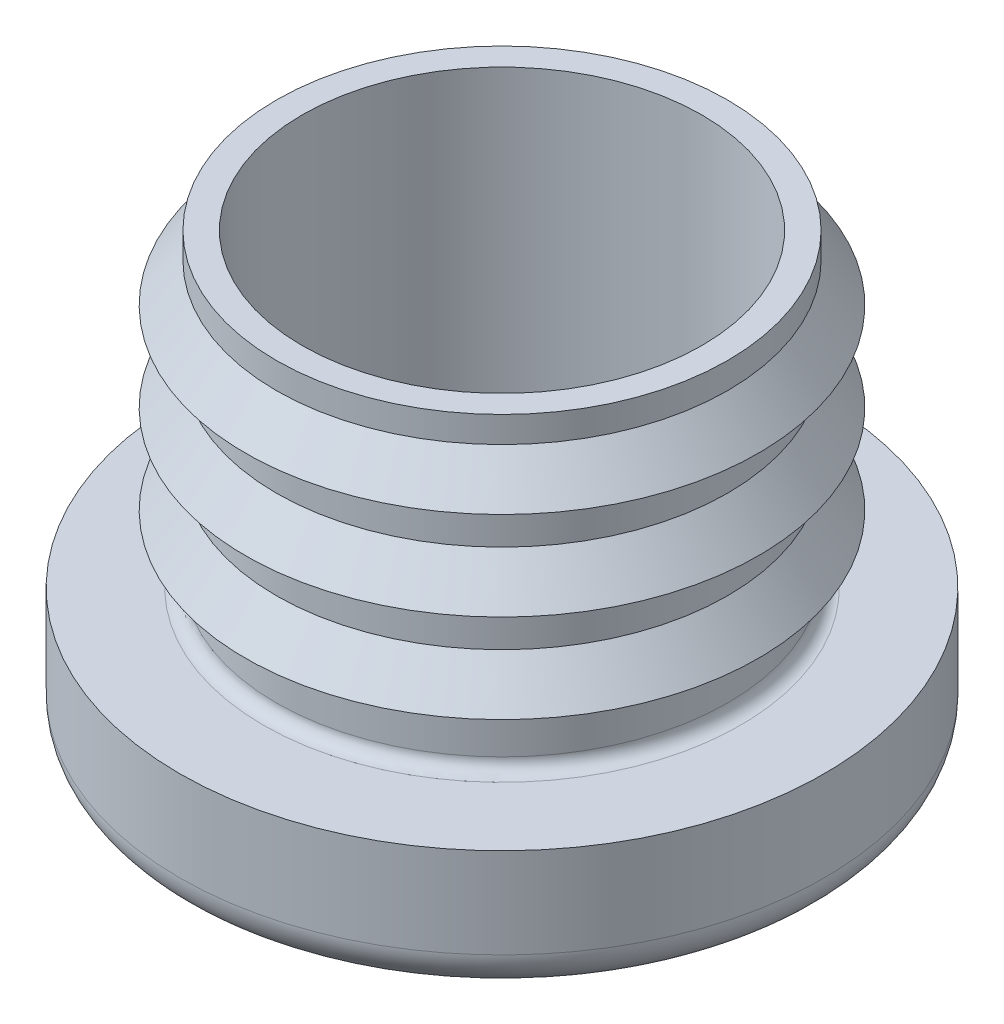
ISO-10303-21;
HEADER;
FILE_DESCRIPTION(('STEP AP214'),'2;1');
FILE_NAME('part.step','',(''),(''),'','','');
FILE_SCHEMA(('AUTOMOTIVE_DESIGN { 1 0 10303 214 1 1 1 1 }'));
ENDSEC;
DATA;
#1=APPLICATION_CONTEXT('core data for automotive mechanical design processes');
#2=APPLICATION_PROTOCOL_DEFINITION('international standard','automotive_design',2000,#1);
#3=PRODUCT_CONTEXT('',#1,'mechanical');
#4=PRODUCT('Part','Part','',(#3));
#5=PRODUCT_RELATED_PRODUCT_CATEGORY('part','',(#4));
#6=PRODUCT_DEFINITION_FORMATION('','',#4);
#7=PRODUCT_DEFINITION_CONTEXT('part definition',#1,'design');
#8=PRODUCT_DEFINITION('design','',#6,#7);
#9=PRODUCT_DEFINITION_SHAPE('','',#8);
#10=(LENGTH_UNIT() NAMED_UNIT(*) SI_UNIT(.MILLI.,.METRE.));
#11=(NAMED_UNIT(*) PLANE_ANGLE_UNIT() SI_UNIT($,.RADIAN.));
#12=(NAMED_UNIT(*) SI_UNIT($,.STERADIAN.) SOLID_ANGLE_UNIT());
#13=UNCERTAINTY_MEASURE_WITH_UNIT(LENGTH_MEASURE(1.E-05),#10,'distance_accuracy_value','');
#14=(GEOMETRIC_REPRESENTATION_CONTEXT(3) GLOBAL_UNCERTAINTY_ASSIGNED_CONTEXT((#13)) GLOBAL_UNIT_ASSIGNED_CONTEXT((#10,
#11,#12)) REPRESENTATION_CONTEXT('',''));
#15=CARTESIAN_POINT('',(0.,0.,0.));
#16=DIRECTION('',(0.,0.,1.));
#17=DIRECTION('',(1.,0.,0.));
#18=AXIS2_PLACEMENT_3D('',#15,#16,#17);
#19=CARTESIAN_POINT('',(0.,1.5,0.));
#20=DIRECTION('',(0.,-1.,0.));
#21=DIRECTION('',(0.,0.,-1.));
#22=AXIS2_PLACEMENT_3D('',#19,#20,#21);
#23=TOROIDAL_SURFACE('',#22,11.,1.5);
#24=CARTESIAN_POINT('',(0.,0.,0.));
#25=DIRECTION('',(0.,-1.,0.));
#26=DIRECTION('',(0.,0.,-1.));
#27=AXIS2_PLACEMENT_3D('',#24,#25,#26);
#28=CIRCLE('',#27,11.);
#29=CARTESIAN_POINT('',(0.,0.,-11.));
#30=VERTEX_POINT('',#29);
#31=EDGE_CURVE('E10',#30,#30,#28,.T.);
#32=ORIENTED_EDGE('',*,*,#31,.F.);
#33=EDGE_LOOP('',(#32));
#34=FACE_BOUND('',#33,.T.);
#35=CARTESIAN_POINT('',(0.,1.5,0.));
#36=DIRECTION('',(0.,-1.,0.));
#37=DIRECTION('',(0.,0.,-1.));
#38=AXIS2_PLACEMENT_3D('',#35,#36,#37);
#39=CIRCLE('',#38,12.5);
#40=CARTESIAN_POINT('',(0.,1.5,-12.5));
#41=VERTEX_POINT('',#40);
#42=EDGE_CURVE('E86',#41,#41,#39,.T.);
#43=ORIENTED_EDGE('',*,*,#42,.T.);
#44=EDGE_LOOP('',(#43));
#45=FACE_BOUND('',#44,.T.);
#46=ADVANCED_FACE('F28',(#34,#45),#23,.T.);
#47=CARTESIAN_POINT('',(-11.,0.,0.));
#48=DIRECTION('',(0.,1.,0.));
#49=DIRECTION('',(0.,0.,1.));
#50=AXIS2_PLACEMENT_3D('',#47,#48,#49);
#51=PLANE('',#50);
#52=ORIENTED_EDGE('',*,*,#31,.T.);
#53=EDGE_LOOP('',(#52));
#54=FACE_BOUND('',#53,.T.);
#55=ADVANCED_FACE('F188',(#54),#51,.F.);
#56=CARTESIAN_POINT('',(0.,3.,0.));
#57=DIRECTION('',(0.,-1.,0.));
#58=DIRECTION('',(0.,0.,-1.));
#59=AXIS2_PLACEMENT_3D('',#56,#57,#58);
#60=PLANE('',#59);
#61=CARTESIAN_POINT('',(0.,3.,0.));
#62=DIRECTION('',(0.,-1.,0.));
#63=DIRECTION('',(0.,0.,-1.));
#64=AXIS2_PLACEMENT_3D('',#61,#62,#63);
#65=CIRCLE('',#64,7.25);
#66=CARTESIAN_POINT('',(0.,3.,-7.25));
#67=VERTEX_POINT('',#66);
#68=EDGE_CURVE('E34',#67,#67,#65,.T.);
#69=ORIENTED_EDGE('',*,*,#68,.F.);
#70=EDGE_LOOP('',(#69));
#71=FACE_BOUND('',#70,.T.);
#72=ADVANCED_FACE('F183',(#71),#60,.F.);
#73=CARTESIAN_POINT('',(0.,3.5,0.));
#74=DIRECTION('',(0.,-1.,0.));
#75=DIRECTION('',(0.,0.,-1.));
#76=AXIS2_PLACEMENT_3D('',#73,#74,#75);
#77=TOROIDAL_SURFACE('',#76,7.25,0.5);
#78=CARTESIAN_POINT('',(0.,3.5,0.));
#79=DIRECTION('',(0.,-1.,0.));
#80=DIRECTION('',(0.,0.,-1.));
#81=AXIS2_PLACEMENT_3D('',#78,#79,#80);
#82=CIRCLE('',#81,7.75);
#83=CARTESIAN_POINT('',(0.,3.5,-7.75));
#84=VERTEX_POINT('',#83);
#85=EDGE_CURVE('E38',#84,#84,#82,.T.);
#86=ORIENTED_EDGE('',*,*,#85,.F.);
#87=EDGE_LOOP('',(#86));
#88=FACE_BOUND('',#87,.T.);
#89=ORIENTED_EDGE('',*,*,#68,.T.);
#90=EDGE_LOOP('',(#89));
#91=FACE_BOUND('',#90,.T.);
#92=ADVANCED_FACE('F178',(#88,#91),#77,.F.);
#93=CARTESIAN_POINT('',(0.,0.,0.));
#94=DIRECTION('',(0.,-1.,0.));
#95=DIRECTION('',(0.,0.,-1.));
#96=AXIS2_PLACEMENT_3D('',#93,#94,#95);
#97=CYLINDRICAL_SURFACE('',#96,7.75);
#98=CARTESIAN_POINT('',(0.,17.,0.));
#99=DIRECTION('',(0.,-1.,0.));
#100=DIRECTION('',(0.,0.,-1.));
#101=AXIS2_PLACEMENT_3D('',#98,#99,#100);
#102=CIRCLE('',#101,7.75);
#103=CARTESIAN_POINT('',(0.,17.,-7.75));
#104=VERTEX_POINT('',#103);
#105=EDGE_CURVE('E42',#104,#104,#102,.T.);
#106=ORIENTED_EDGE('',*,*,#105,.F.);
#107=EDGE_LOOP('',(#106));
#108=FACE_BOUND('',#107,.T.);
#109=ORIENTED_EDGE('',*,*,#85,.T.);
#110=EDGE_LOOP('',(#109));
#111=FACE_BOUND('',#110,.T.);
#112=ADVANCED_FACE('F172',(#108,#111),#97,.F.);
#113=CARTESIAN_POINT('',(-7.75,17.,0.));
#114=DIRECTION('',(0.,-1.,0.));
#115=DIRECTION('',(0.,0.,-1.));
#116=AXIS2_PLACEMENT_3D('',#113,#114,#115);
#117=PLANE('',#116);
#118=CARTESIAN_POINT('',(0.,17.,0.));
#119=DIRECTION('',(0.,-1.,0.));
#120=DIRECTION('',(0.,0.,-1.));
#121=AXIS2_PLACEMENT_3D('',#118,#119,#120);
#122=CIRCLE('',#121,8.75000000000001);
#123=CARTESIAN_POINT('',(0.,17.,-8.75000000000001));
#124=VERTEX_POINT('',#123);
#125=EDGE_CURVE('E47',#124,#124,#122,.T.);
#126=ORIENTED_EDGE('',*,*,#125,.F.);
#127=EDGE_LOOP('',(#126));
#128=FACE_BOUND('',#127,.T.);
#129=ORIENTED_EDGE('',*,*,#105,.T.);
#130=EDGE_LOOP('',(#129));
#131=FACE_BOUND('',#130,.T.);
#132=ADVANCED_FACE('F166',(#128,#131),#117,.F.);
#133=CARTESIAN_POINT('',(0.,0.,0.));
#134=DIRECTION('',(0.,-1.,0.));
#135=DIRECTION('',(0.,0.,-1.));
#136=AXIS2_PLACEMENT_3D('',#133,#134,#135);
#137=CYLINDRICAL_SURFACE('',#136,8.75000000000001);
#138=CARTESIAN_POINT('',(0.,15.9876094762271,0.));
#139=DIRECTION('',(0.,-1.,0.));
#140=DIRECTION('',(0.,0.,-1.));
#141=AXIS2_PLACEMENT_3D('',#138,#139,#140);
#142=CIRCLE('',#141,8.75000000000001);
#143=CARTESIAN_POINT('',(0.,15.9876094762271,-8.75000000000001));
#144=VERTEX_POINT('',#143);
#145=EDGE_CURVE('E50',#144,#144,#142,.T.);
#146=ORIENTED_EDGE('',*,*,#145,.F.);
#147=EDGE_LOOP('',(#146));
#148=FACE_BOUND('',#147,.T.);
#149=ORIENTED_EDGE('',*,*,#125,.T.);
#150=EDGE_LOOP('',(#149));
#151=FACE_BOUND('',#150,.T.);
#152=ADVANCED_FACE('F160',(#148,#151),#137,.T.);
#153=CARTESIAN_POINT('',(0.,15.9876094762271,0.));
#154=DIRECTION('',(0.,-1.,0.));
#155=DIRECTION('',(0.,0.,-1.));
#156=AXIS2_PLACEMENT_3D('',#153,#154,#155);
#157=CONICAL_SURFACE('',#156,8.75000000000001,0.67460878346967);
#158=CARTESIAN_POINT('',(0.,14.4876094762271,0.));
#159=DIRECTION('',(0.,-1.,0.));
#160=DIRECTION('',(0.,0.,-1.));
#161=AXIS2_PLACEMENT_3D('',#158,#159,#160);
#162=CIRCLE('',#161,9.94967492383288);
#163=CARTESIAN_POINT('',(0.,14.4876094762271,-9.94967492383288));
#164=VERTEX_POINT('',#163);
#165=EDGE_CURVE('E53',#164,#164,#162,.T.);
#166=ORIENTED_EDGE('',*,*,#165,.F.);
#167=EDGE_LOOP('',(#166));
#168=FACE_BOUND('',#167,.T.);
#169=ORIENTED_EDGE('',*,*,#145,.T.);
#170=EDGE_LOOP('',(#169));
#171=FACE_BOUND('',#170,.T.);
#172=ADVANCED_FACE('F154',(#168,#171),#157,.T.);
#173=CARTESIAN_POINT('',(-9.94967492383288,14.4876094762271,0.));
#174=DIRECTION('',(0.,1.,0.));
#175=DIRECTION('',(0.,0.,1.));
#176=AXIS2_PLACEMENT_3D('',#173,#174,#175);
#177=PLANE('',#176);
#178=CARTESIAN_POINT('',(0.,14.4876094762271,0.));
#179=DIRECTION('',(0.,-1.,0.));
#180=DIRECTION('',(0.,0.,-1.));
#181=AXIS2_PLACEMENT_3D('',#178,#179,#180);
#182=CIRCLE('',#181,8.75000000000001);
#183=CARTESIAN_POINT('',(0.,14.4876094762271,-8.75000000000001));
#184=VERTEX_POINT('',#183);
#185=EDGE_CURVE('E56',#184,#184,#182,.T.);
#186=ORIENTED_EDGE('',*,*,#185,.F.);
#187=EDGE_LOOP('',(#186));
#188=FACE_BOUND('',#187,.T.);
#189=ORIENTED_EDGE('',*,*,#165,.T.);
#190=EDGE_LOOP('',(#189));
#191=FACE_BOUND('',#190,.T.);
#192=ADVANCED_FACE('F148',(#188,#191),#177,.F.);
#193=CARTESIAN_POINT('',(0.,0.,0.));
#194=DIRECTION('',(0.,-1.,0.));
#195=DIRECTION('',(0.,0.,-1.));
#196=AXIS2_PLACEMENT_3D('',#193,#194,#195);
#197=CYLINDRICAL_SURFACE('',#196,8.75000000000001);
#198=CARTESIAN_POINT('',(0.,12.5438047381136,0.));
#199=DIRECTION('',(0.,-1.,0.));
#200=DIRECTION('',(0.,0.,-1.));
#201=AXIS2_PLACEMENT_3D('',#198,#199,#200);
#202=CIRCLE('',#201,8.75000000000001);
#203=CARTESIAN_POINT('',(0.,12.5438047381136,-8.75000000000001));
#204=VERTEX_POINT('',#203);
#205=EDGE_CURVE('E59',#204,#204,#202,.T.);
#206=ORIENTED_EDGE('',*,*,#205,.F.);
#207=EDGE_LOOP('',(#206));
#208=FACE_BOUND('',#207,.T.);
#209=ORIENTED_EDGE('',*,*,#185,.T.);
#210=EDGE_LOOP('',(#209));
#211=FACE_BOUND('',#210,.T.);
#212=ADVANCED_FACE('F142',(#208,#211),#197,.T.);
#213=CARTESIAN_POINT('',(0.,12.5438047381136,0.));
#214=DIRECTION('',(0.,-1.,0.));
#215=DIRECTION('',(0.,0.,-1.));
#216=AXIS2_PLACEMENT_3D('',#213,#214,#215);
#217=CONICAL_SURFACE('',#216,8.75000000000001,0.674608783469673);
#218=CARTESIAN_POINT('',(0.,11.0438047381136,0.));
#219=DIRECTION('',(0.,-1.,0.));
#220=DIRECTION('',(0.,0.,-1.));
#221=AXIS2_PLACEMENT_3D('',#218,#219,#220);
#222=CIRCLE('',#221,9.94967492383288);
#223=CARTESIAN_POINT('',(0.,11.0438047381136,-9.94967492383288));
#224=VERTEX_POINT('',#223);
#225=EDGE_CURVE('E62',#224,#224,#222,.T.);
#226=ORIENTED_EDGE('',*,*,#225,.F.);
#227=EDGE_LOOP('',(#226));
#228=FACE_BOUND('',#227,.T.);
#229=ORIENTED_EDGE('',*,*,#205,.T.);
#230=EDGE_LOOP('',(#229));
#231=FACE_BOUND('',#230,.T.);
#232=ADVANCED_FACE('F136',(#228,#231),#217,.T.);
#233=CARTESIAN_POINT('',(-9.94967492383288,11.0438047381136,0.));
#234=DIRECTION('',(0.,1.,0.));
#235=DIRECTION('',(0.,0.,1.));
#236=AXIS2_PLACEMENT_3D('',#233,#234,#235);
#237=PLANE('',#236);
#238=CARTESIAN_POINT('',(0.,11.0438047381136,0.));
#239=DIRECTION('',(0.,-1.,0.));
#240=DIRECTION('',(0.,0.,-1.));
#241=AXIS2_PLACEMENT_3D('',#238,#239,#240);
#242=CIRCLE('',#241,8.75000000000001);
#243=CARTESIAN_POINT('',(0.,11.0438047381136,-8.75000000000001));
#244=VERTEX_POINT('',#243);
#245=EDGE_CURVE('E65',#244,#244,#242,.T.);
#246=ORIENTED_EDGE('',*,*,#245,.F.);
#247=EDGE_LOOP('',(#246));
#248=FACE_BOUND('',#247,.T.);
#249=ORIENTED_EDGE('',*,*,#225,.T.);
#250=EDGE_LOOP('',(#249));
#251=FACE_BOUND('',#250,.T.);
#252=ADVANCED_FACE('F130',(#248,#251),#237,.F.);
#253=CARTESIAN_POINT('',(0.,0.,0.));
#254=DIRECTION('',(0.,-1.,0.));
#255=DIRECTION('',(0.,0.,-1.));
#256=AXIS2_PLACEMENT_3D('',#253,#254,#255);
#257=CYLINDRICAL_SURFACE('',#256,8.75);
#258=CARTESIAN_POINT('',(0.,9.1,0.));
#259=DIRECTION('',(0.,-1.,0.));
#260=DIRECTION('',(0.,0.,-1.));
#261=AXIS2_PLACEMENT_3D('',#258,#259,#260);
#262=CIRCLE('',#261,8.75);
#263=CARTESIAN_POINT('',(0.,9.1,-8.75));
#264=VERTEX_POINT('',#263);
#265=EDGE_CURVE('E68',#264,#264,#262,.T.);
#266=ORIENTED_EDGE('',*,*,#265,.F.);
#267=EDGE_LOOP('',(#266));
#268=FACE_BOUND('',#267,.T.);
#269=ORIENTED_EDGE('',*,*,#245,.T.);
#270=EDGE_LOOP('',(#269));
#271=FACE_BOUND('',#270,.T.);
#272=ADVANCED_FACE('F124',(#268,#271),#257,.T.);
#273=CARTESIAN_POINT('',(0.,9.1,0.));
#274=DIRECTION('',(0.,-1.,0.));
#275=DIRECTION('',(0.,0.,-1.));
#276=AXIS2_PLACEMENT_3D('',#273,#274,#275);
#277=CONICAL_SURFACE('',#276,8.75,0.674608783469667);
#278=CARTESIAN_POINT('',(0.,7.6,0.));
#279=DIRECTION('',(0.,-1.,0.));
#280=DIRECTION('',(0.,0.,-1.));
#281=AXIS2_PLACEMENT_3D('',#278,#279,#280);
#282=CIRCLE('',#281,9.94967492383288);
#283=CARTESIAN_POINT('',(0.,7.6,-9.94967492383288));
#284=VERTEX_POINT('',#283);
#285=EDGE_CURVE('E71',#284,#284,#282,.T.);
#286=ORIENTED_EDGE('',*,*,#285,.F.);
#287=EDGE_LOOP('',(#286));
#288=FACE_BOUND('',#287,.T.);
#289=ORIENTED_EDGE('',*,*,#265,.T.);
#290=EDGE_LOOP('',(#289));
#291=FACE_BOUND('',#290,.T.);
#292=ADVANCED_FACE('F118',(#288,#291),#277,.T.);
#293=CARTESIAN_POINT('',(-9.94967492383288,7.6,0.));
#294=DIRECTION('',(0.,1.,0.));
#295=DIRECTION('',(0.,0.,1.));
#296=AXIS2_PLACEMENT_3D('',#293,#294,#295);
#297=PLANE('',#296);
#298=CARTESIAN_POINT('',(0.,7.6,0.));
#299=DIRECTION('',(0.,-1.,0.));
#300=DIRECTION('',(0.,0.,-1.));
#301=AXIS2_PLACEMENT_3D('',#298,#299,#300);
#302=CIRCLE('',#301,8.75);
#303=CARTESIAN_POINT('',(0.,7.6,-8.75));
#304=VERTEX_POINT('',#303);
#305=EDGE_CURVE('E74',#304,#304,#302,.T.);
#306=ORIENTED_EDGE('',*,*,#305,.F.);
#307=EDGE_LOOP('',(#306));
#308=FACE_BOUND('',#307,.T.);
#309=ORIENTED_EDGE('',*,*,#285,.T.);
#310=EDGE_LOOP('',(#309));
#311=FACE_BOUND('',#310,.T.);
#312=ADVANCED_FACE('F112',(#308,#311),#297,.F.);
#313=CARTESIAN_POINT('',(0.,0.,0.));
#314=DIRECTION('',(0.,-1.,0.));
#315=DIRECTION('',(0.,0.,-1.));
#316=AXIS2_PLACEMENT_3D('',#313,#314,#315);
#317=CYLINDRICAL_SURFACE('',#316,8.75);
#318=CARTESIAN_POINT('',(0.,5.5,0.));
#319=DIRECTION('',(0.,-1.,0.));
#320=DIRECTION('',(0.,0.,-1.));
#321=AXIS2_PLACEMENT_3D('',#318,#319,#320);
#322=CIRCLE('',#321,8.75);
#323=CARTESIAN_POINT('',(0.,5.5,-8.75));
#324=VERTEX_POINT('',#323);
#325=EDGE_CURVE('E77',#324,#324,#322,.T.);
#326=ORIENTED_EDGE('',*,*,#325,.F.);
#327=EDGE_LOOP('',(#326));
#328=FACE_BOUND('',#327,.T.);
#329=ORIENTED_EDGE('',*,*,#305,.T.);
#330=EDGE_LOOP('',(#329));
#331=FACE_BOUND('',#330,.T.);
#332=ADVANCED_FACE('F106',(#328,#331),#317,.T.);
#333=CARTESIAN_POINT('',(0.,5.5,0.));
#334=DIRECTION('',(0.,-1.,0.));
#335=DIRECTION('',(0.,0.,-1.));
#336=AXIS2_PLACEMENT_3D('',#333,#334,#335);
#337=TOROIDAL_SURFACE('',#336,9.25000000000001,0.500000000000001);
#338=CARTESIAN_POINT('',(0.,5.,0.));
#339=DIRECTION('',(0.,-1.,0.));
#340=DIRECTION('',(0.,0.,-1.));
#341=AXIS2_PLACEMENT_3D('',#338,#339,#340);
#342=CIRCLE('',#341,9.25000000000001);
#343=CARTESIAN_POINT('',(0.,5.,-9.25000000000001));
#344=VERTEX_POINT('',#343);
#345=EDGE_CURVE('E80',#344,#344,#342,.T.);
#346=ORIENTED_EDGE('',*,*,#345,.F.);
#347=EDGE_LOOP('',(#346));
#348=FACE_BOUND('',#347,.T.);
#349=ORIENTED_EDGE('',*,*,#325,.T.);
#350=EDGE_LOOP('',(#349));
#351=FACE_BOUND('',#350,.T.);
#352=ADVANCED_FACE('F100',(#348,#351),#337,.F.);
#353=CARTESIAN_POINT('',(-9.25000000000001,5.,0.));
#354=DIRECTION('',(0.,-1.,0.));
#355=DIRECTION('',(0.,0.,-1.));
#356=AXIS2_PLACEMENT_3D('',#353,#354,#355);
#357=PLANE('',#356);
#358=CARTESIAN_POINT('',(0.,5.,0.));
#359=DIRECTION('',(0.,-1.,0.));
#360=DIRECTION('',(0.,0.,-1.));
#361=AXIS2_PLACEMENT_3D('',#358,#359,#360);
#362=CIRCLE('',#361,12.5);
#363=CARTESIAN_POINT('',(0.,5.,-12.5));
#364=VERTEX_POINT('',#363);
#365=EDGE_CURVE('E83',#364,#364,#362,.T.);
#366=ORIENTED_EDGE('',*,*,#365,.F.);
#367=EDGE_LOOP('',(#366));
#368=FACE_BOUND('',#367,.T.);
#369=ORIENTED_EDGE('',*,*,#345,.T.);
#370=EDGE_LOOP('',(#369));
#371=FACE_BOUND('',#370,.T.);
#372=ADVANCED_FACE('F94',(#368,#371),#357,.F.);
#373=CARTESIAN_POINT('',(0.,0.,0.));
#374=DIRECTION('',(0.,-1.,0.));
#375=DIRECTION('',(0.,0.,-1.));
#376=AXIS2_PLACEMENT_3D('',#373,#374,#375);
#377=CYLINDRICAL_SURFACE('',#376,12.5);
#378=ORIENTED_EDGE('',*,*,#42,.F.);
#379=EDGE_LOOP('',(#378));
#380=FACE_BOUND('',#379,.T.);
#381=ORIENTED_EDGE('',*,*,#365,.T.);
#382=EDGE_LOOP('',(#381));
#383=FACE_BOUND('',#382,.T.);
#384=ADVANCED_FACE('F91',(#380,#383),#377,.T.);
#385=CLOSED_SHELL('',(#46,#55,#72,#92,#112,#132,#152,#172,#192,#212,#232,#252,#272,#292,#312,
#332,#352,#372,#384));
#386=MANIFOLD_SOLID_BREP('B2',#385);
#387=ADVANCED_BREP_SHAPE_REPRESENTATION('',(#18,#386),#14);
#388=SHAPE_DEFINITION_REPRESENTATION(#9,#387);
ENDSEC;
END-ISO-10303-21;
